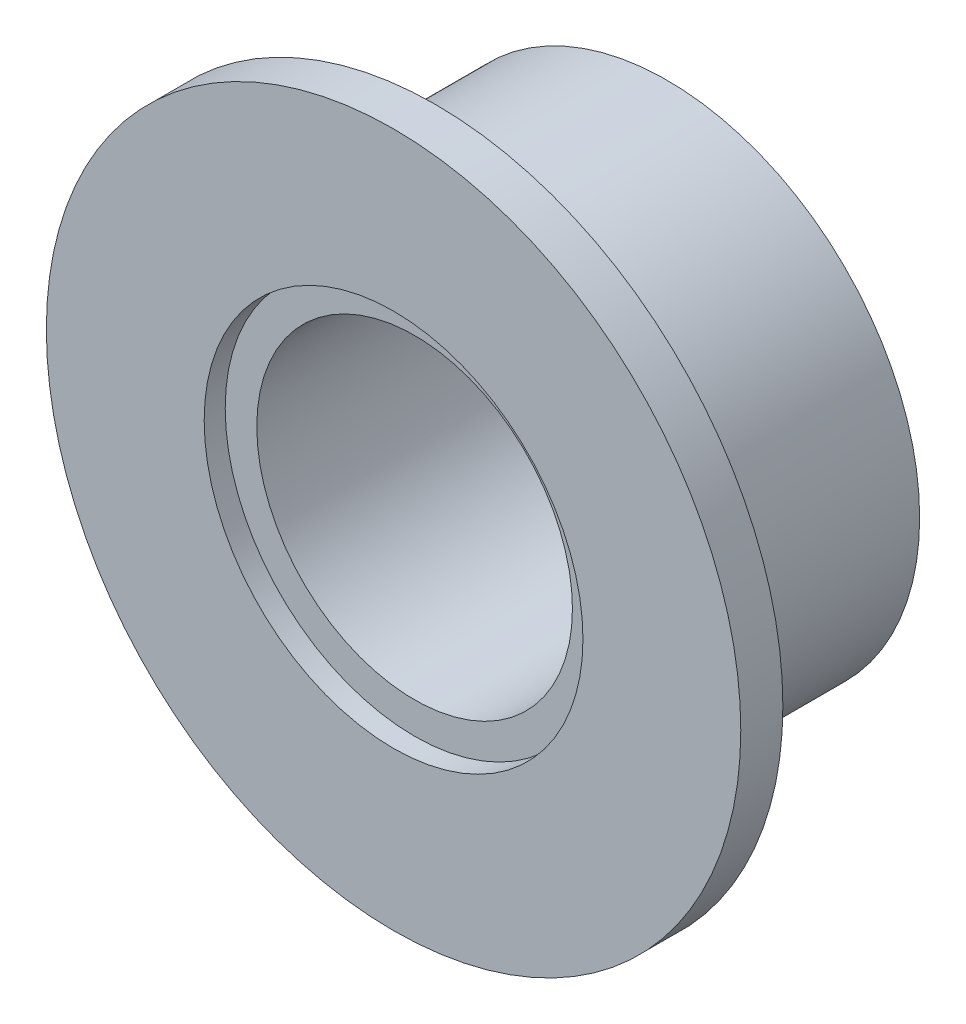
ISO-10303-21;
HEADER;
FILE_DESCRIPTION(('STEP AP214'),'2;1');
FILE_NAME('part.step','',(''),(''),'','','');
FILE_SCHEMA(('AUTOMOTIVE_DESIGN { 1 0 10303 214 1 1 1 1 }'));
ENDSEC;
DATA;
#1=APPLICATION_CONTEXT('core data for automotive mechanical design processes');
#2=APPLICATION_PROTOCOL_DEFINITION('international standard','automotive_design',2000,#1);
#3=PRODUCT_CONTEXT('',#1,'mechanical');
#4=PRODUCT('Part','Part','',(#3));
#5=PRODUCT_RELATED_PRODUCT_CATEGORY('part','',(#4));
#6=PRODUCT_DEFINITION_FORMATION('','',#4);
#7=PRODUCT_DEFINITION_CONTEXT('part definition',#1,'design');
#8=PRODUCT_DEFINITION('design','',#6,#7);
#9=PRODUCT_DEFINITION_SHAPE('','',#8);
#10=(LENGTH_UNIT() NAMED_UNIT(*) SI_UNIT(.MILLI.,.METRE.));
#11=(NAMED_UNIT(*) PLANE_ANGLE_UNIT() SI_UNIT($,.RADIAN.));
#12=(NAMED_UNIT(*) SI_UNIT($,.STERADIAN.) SOLID_ANGLE_UNIT());
#13=UNCERTAINTY_MEASURE_WITH_UNIT(LENGTH_MEASURE(1.E-05),#10,'distance_accuracy_value','');
#14=(GEOMETRIC_REPRESENTATION_CONTEXT(3) GLOBAL_UNCERTAINTY_ASSIGNED_CONTEXT((#13)) GLOBAL_UNIT_ASSIGNED_CONTEXT((#10,
#11,#12)) REPRESENTATION_CONTEXT('',''));
#15=CARTESIAN_POINT('',(0.,0.,0.));
#16=DIRECTION('',(0.,0.,1.));
#17=DIRECTION('',(1.,0.,0.));
#18=AXIS2_PLACEMENT_3D('',#15,#16,#17);
#19=CARTESIAN_POINT('',(0.,0.,11.));
#20=DIRECTION('',(0.,0.,-1.));
#21=DIRECTION('',(-1.,0.,0.));
#22=AXIS2_PLACEMENT_3D('',#19,#20,#21);
#23=CYLINDRICAL_SURFACE('',#22,12.);
#24=CARTESIAN_POINT('',(0.,0.,11.));
#25=DIRECTION('',(0.,0.,1.));
#26=DIRECTION('',(1.,0.,0.));
#27=AXIS2_PLACEMENT_3D('',#24,#25,#26);
#28=CIRCLE('',#27,12.);
#29=CARTESIAN_POINT('',(12.,0.,11.));
#30=VERTEX_POINT('',#29);
#31=EDGE_CURVE('E10',#30,#30,#28,.T.);
#32=ORIENTED_EDGE('',*,*,#31,.F.);
#33=EDGE_LOOP('',(#32));
#34=FACE_BOUND('',#33,.T.);
#35=CARTESIAN_POINT('',(0.,0.,0.));
#36=DIRECTION('',(0.,0.,1.));
#37=DIRECTION('',(1.,0.,0.));
#38=AXIS2_PLACEMENT_3D('',#35,#36,#37);
#39=CIRCLE('',#38,12.);
#40=CARTESIAN_POINT('',(12.,0.,0.));
#41=VERTEX_POINT('',#40);
#42=EDGE_CURVE('E42',#41,#41,#39,.T.);
#43=ORIENTED_EDGE('',*,*,#42,.T.);
#44=EDGE_LOOP('',(#43));
#45=FACE_BOUND('',#44,.T.);
#46=ADVANCED_FACE('F35',(#34,#45),#23,.T.);
#47=CARTESIAN_POINT('',(0.,0.,0.));
#48=DIRECTION('',(0.,0.,1.));
#49=DIRECTION('',(1.,0.,0.));
#50=AXIS2_PLACEMENT_3D('',#47,#48,#49);
#51=PLANE('',#50);
#52=CARTESIAN_POINT('',(0.,0.,0.));
#53=DIRECTION('',(0.,0.,1.));
#54=DIRECTION('',(1.,0.,0.));
#55=AXIS2_PLACEMENT_3D('',#52,#53,#54);
#56=CIRCLE('',#55,7.49999999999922);
#57=CARTESIAN_POINT('',(7.49999999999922,0.,0.));
#58=VERTEX_POINT('',#57);
#59=EDGE_CURVE('E38',#58,#58,#56,.T.);
#60=ORIENTED_EDGE('',*,*,#59,.T.);
#61=EDGE_LOOP('',(#60));
#62=FACE_BOUND('',#61,.T.);
#63=ORIENTED_EDGE('',*,*,#42,.F.);
#64=EDGE_LOOP('',(#63));
#65=FACE_BOUND('',#64,.T.);
#66=ADVANCED_FACE('F76',(#62,#65),#51,.F.);
#67=CARTESIAN_POINT('',(0.,0.,13.));
#68=DIRECTION('',(0.,0.,-1.));
#69=DIRECTION('',(-1.,0.,0.));
#70=AXIS2_PLACEMENT_3D('',#67,#68,#69);
#71=CYLINDRICAL_SURFACE('',#70,16.5);
#72=CARTESIAN_POINT('',(0.,0.,13.));
#73=DIRECTION('',(0.,0.,1.));
#74=DIRECTION('',(1.,0.,0.));
#75=AXIS2_PLACEMENT_3D('',#72,#73,#74);
#76=CIRCLE('',#75,16.5);
#77=CARTESIAN_POINT('',(16.5,0.,13.));
#78=VERTEX_POINT('',#77);
#79=EDGE_CURVE('E47',#78,#78,#76,.T.);
#80=ORIENTED_EDGE('',*,*,#79,.F.);
#81=EDGE_LOOP('',(#80));
#82=FACE_BOUND('',#81,.T.);
#83=CARTESIAN_POINT('',(0.,0.,11.));
#84=DIRECTION('',(0.,0.,1.));
#85=DIRECTION('',(1.,0.,0.));
#86=AXIS2_PLACEMENT_3D('',#83,#84,#85);
#87=CIRCLE('',#86,16.5);
#88=CARTESIAN_POINT('',(16.5,0.,11.));
#89=VERTEX_POINT('',#88);
#90=EDGE_CURVE('E49',#89,#89,#87,.T.);
#91=ORIENTED_EDGE('',*,*,#90,.T.);
#92=EDGE_LOOP('',(#91));
#93=FACE_BOUND('',#92,.T.);
#94=ADVANCED_FACE('F70',(#82,#93),#71,.T.);
#95=CARTESIAN_POINT('',(0.,0.,13.));
#96=DIRECTION('',(0.,0.,1.));
#97=DIRECTION('',(1.,0.,0.));
#98=AXIS2_PLACEMENT_3D('',#95,#96,#97);
#99=PLANE('',#98);
#100=CARTESIAN_POINT('',(0.,0.,13.));
#101=DIRECTION('',(0.,0.,1.));
#102=DIRECTION('',(1.,0.,0.));
#103=AXIS2_PLACEMENT_3D('',#100,#101,#102);
#104=CIRCLE('',#103,9.00000000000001);
#105=CARTESIAN_POINT('',(9.00000000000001,0.,13.));
#106=VERTEX_POINT('',#105);
#107=EDGE_CURVE('E60',#106,#106,#104,.T.);
#108=ORIENTED_EDGE('',*,*,#107,.F.);
#109=EDGE_LOOP('',(#108));
#110=FACE_BOUND('',#109,.T.);
#111=ORIENTED_EDGE('',*,*,#79,.T.);
#112=EDGE_LOOP('',(#111));
#113=FACE_BOUND('',#112,.T.);
#114=ADVANCED_FACE('F66',(#110,#113),#99,.T.);
#115=CARTESIAN_POINT('',(0.,0.,11.));
#116=DIRECTION('',(0.,0.,1.));
#117=DIRECTION('',(1.,0.,0.));
#118=AXIS2_PLACEMENT_3D('',#115,#116,#117);
#119=PLANE('',#118);
#120=ORIENTED_EDGE('',*,*,#31,.T.);
#121=EDGE_LOOP('',(#120));
#122=FACE_BOUND('',#121,.T.);
#123=ORIENTED_EDGE('',*,*,#90,.F.);
#124=EDGE_LOOP('',(#123));
#125=FACE_BOUND('',#124,.T.);
#126=ADVANCED_FACE('F69',(#122,#125),#119,.F.);
#127=CARTESIAN_POINT('',(0.,0.,13.));
#128=DIRECTION('',(0.,0.,1.));
#129=DIRECTION('',(1.,0.,0.));
#130=AXIS2_PLACEMENT_3D('',#127,#128,#129);
#131=CYLINDRICAL_SURFACE('',#130,7.49999999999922);
#132=CARTESIAN_POINT('',(0.,0.,12.));
#133=DIRECTION('',(0.,0.,1.));
#134=DIRECTION('',(1.,0.,0.));
#135=AXIS2_PLACEMENT_3D('',#132,#133,#134);
#136=CIRCLE('',#135,7.50000000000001);
#137=CARTESIAN_POINT('',(7.50000000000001,0.,12.));
#138=VERTEX_POINT('',#137);
#139=EDGE_CURVE('E54',#138,#138,#136,.T.);
#140=ORIENTED_EDGE('',*,*,#139,.T.);
#141=EDGE_LOOP('',(#140));
#142=FACE_BOUND('',#141,.T.);
#143=ORIENTED_EDGE('',*,*,#59,.F.);
#144=EDGE_LOOP('',(#143));
#145=FACE_BOUND('',#144,.T.);
#146=ADVANCED_FACE('F81',(#142,#145),#131,.F.);
#147=CARTESIAN_POINT('',(7.50000000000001,0.,12.));
#148=DIRECTION('',(0.,0.,-1.));
#149=DIRECTION('',(-1.,0.,0.));
#150=AXIS2_PLACEMENT_3D('',#147,#148,#149);
#151=PLANE('',#150);
#152=ORIENTED_EDGE('',*,*,#139,.F.);
#153=EDGE_LOOP('',(#152));
#154=FACE_BOUND('',#153,.T.);
#155=CARTESIAN_POINT('',(0.,0.,12.));
#156=DIRECTION('',(0.,0.,1.));
#157=DIRECTION('',(1.,0.,0.));
#158=AXIS2_PLACEMENT_3D('',#155,#156,#157);
#159=CIRCLE('',#158,9.00000000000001);
#160=CARTESIAN_POINT('',(9.00000000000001,0.,12.));
#161=VERTEX_POINT('',#160);
#162=EDGE_CURVE('E57',#161,#161,#159,.T.);
#163=ORIENTED_EDGE('',*,*,#162,.T.);
#164=EDGE_LOOP('',(#163));
#165=FACE_BOUND('',#164,.T.);
#166=ADVANCED_FACE('F86',(#154,#165),#151,.F.);
#167=CARTESIAN_POINT('',(0.,0.,13.));
#168=DIRECTION('',(0.,0.,1.));
#169=DIRECTION('',(1.,0.,0.));
#170=AXIS2_PLACEMENT_3D('',#167,#168,#169);
#171=CYLINDRICAL_SURFACE('',#170,9.00000000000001);
#172=ORIENTED_EDGE('',*,*,#162,.F.);
#173=EDGE_LOOP('',(#172));
#174=FACE_BOUND('',#173,.T.);
#175=ORIENTED_EDGE('',*,*,#107,.T.);
#176=EDGE_LOOP('',(#175));
#177=FACE_BOUND('',#176,.T.);
#178=ADVANCED_FACE('F64',(#174,#177),#171,.F.);
#179=CLOSED_SHELL('',(#46,#66,#94,#114,#126,#146,#166,#178));
#180=MANIFOLD_SOLID_BREP('B2',#179);
#181=ADVANCED_BREP_SHAPE_REPRESENTATION('',(#18,#180),#14);
#182=SHAPE_DEFINITION_REPRESENTATION(#9,#181);
ENDSEC;
END-ISO-10303-21;
